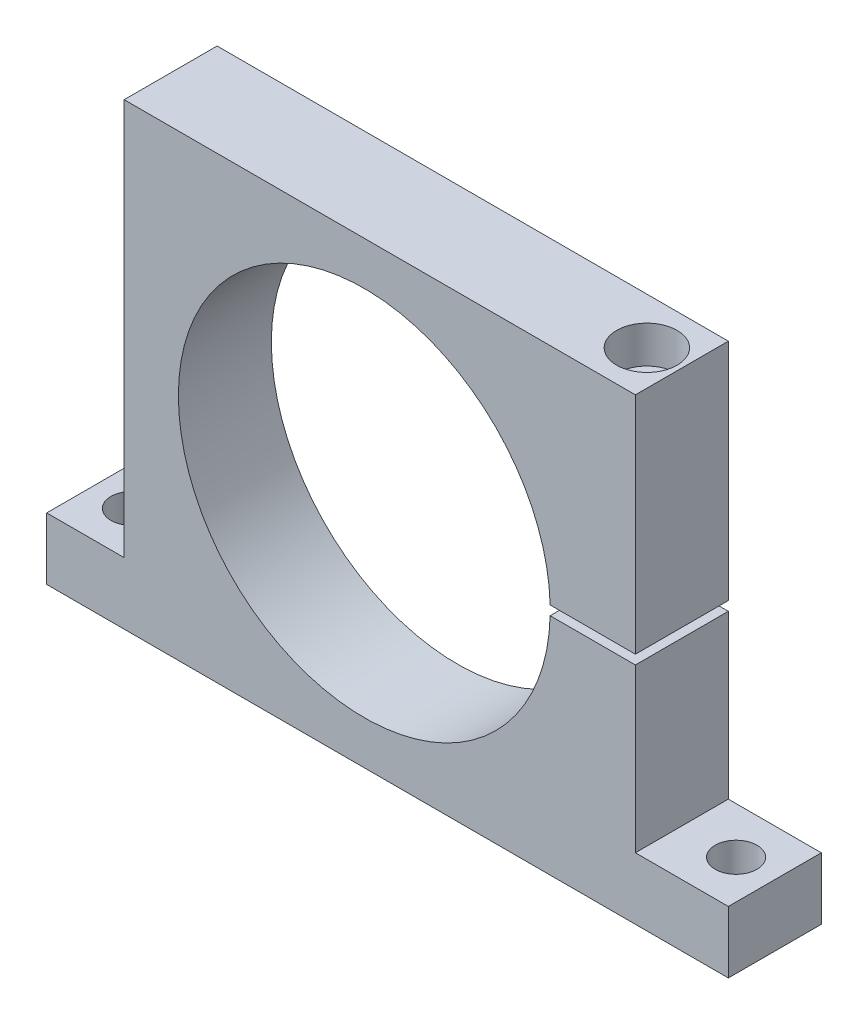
ISO-10303-21;
HEADER;
FILE_DESCRIPTION(('STEP AP214'),'2;1');
FILE_NAME('part.step','',(''),(''),'','','');
FILE_SCHEMA(('AUTOMOTIVE_DESIGN { 1 0 10303 214 1 1 1 1 }'));
ENDSEC;
DATA;
#1=APPLICATION_CONTEXT('core data for automotive mechanical design processes');
#2=APPLICATION_PROTOCOL_DEFINITION('international standard','automotive_design',2000,#1);
#3=PRODUCT_CONTEXT('',#1,'mechanical');
#4=PRODUCT('Part','Part','',(#3));
#5=PRODUCT_RELATED_PRODUCT_CATEGORY('part','',(#4));
#6=PRODUCT_DEFINITION_FORMATION('','',#4);
#7=PRODUCT_DEFINITION_CONTEXT('part definition',#1,'design');
#8=PRODUCT_DEFINITION('design','',#6,#7);
#9=PRODUCT_DEFINITION_SHAPE('','',#8);
#10=(LENGTH_UNIT() NAMED_UNIT(*) SI_UNIT(.MILLI.,.METRE.));
#11=(NAMED_UNIT(*) PLANE_ANGLE_UNIT() SI_UNIT($,.RADIAN.));
#12=(NAMED_UNIT(*) SI_UNIT($,.STERADIAN.) SOLID_ANGLE_UNIT());
#13=UNCERTAINTY_MEASURE_WITH_UNIT(LENGTH_MEASURE(1.E-05),#10,'distance_accuracy_value','');
#14=(GEOMETRIC_REPRESENTATION_CONTEXT(3) GLOBAL_UNCERTAINTY_ASSIGNED_CONTEXT((#13)) GLOBAL_UNIT_ASSIGNED_CONTEXT((#10,
#11,#12)) REPRESENTATION_CONTEXT('',''));
#15=CARTESIAN_POINT('',(0.,0.,0.));
#16=DIRECTION('',(0.,0.,1.));
#17=DIRECTION('',(1.,0.,0.));
#18=AXIS2_PLACEMENT_3D('',#15,#16,#17);
#19=CARTESIAN_POINT('',(87.5,1.49999999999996,15.));
#20=DIRECTION('',(0.,1.,0.));
#21=DIRECTION('',(0.,0.,1.));
#22=AXIS2_PLACEMENT_3D('',#19,#20,#21);
#23=PLANE('',#22);
#24=DIRECTION('',(1.,0.,0.));
#25=VECTOR('',#24,1.);
#26=CARTESIAN_POINT('',(87.5,1.49999999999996,-15.));
#27=LINE('',#26,#25);
#28=CARTESIAN_POINT('',(59.9812470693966,1.49999999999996,-15.));
#29=VERTEX_POINT('',#28);
#30=CARTESIAN_POINT('',(87.5,1.49999999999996,-15.));
#31=VERTEX_POINT('',#30);
#32=EDGE_CURVE('E164',#29,#31,#27,.T.);
#33=ORIENTED_EDGE('',*,*,#32,.T.);
#34=DIRECTION('',(0.,0.,-1.));
#35=VECTOR('',#34,1.);
#36=CARTESIAN_POINT('',(87.5,1.49999999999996,15.));
#37=LINE('',#36,#35);
#38=CARTESIAN_POINT('',(87.5,1.49999999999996,15.));
#39=VERTEX_POINT('',#38);
#40=EDGE_CURVE('E47',#39,#31,#37,.T.);
#41=ORIENTED_EDGE('',*,*,#40,.F.);
#42=DIRECTION('',(1.,0.,0.));
#43=VECTOR('',#42,1.);
#44=CARTESIAN_POINT('',(87.5,1.49999999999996,15.));
#45=LINE('',#44,#43);
#46=CARTESIAN_POINT('',(59.9812470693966,1.49999999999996,15.));
#47=VERTEX_POINT('',#46);
#48=EDGE_CURVE('E111',#47,#39,#45,.T.);
#49=ORIENTED_EDGE('',*,*,#48,.F.);
#50=DIRECTION('',(0.,0.,-1.));
#51=VECTOR('',#50,1.);
#52=CARTESIAN_POINT('',(59.9812470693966,1.49999999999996,15.));
#53=LINE('',#52,#51);
#54=EDGE_CURVE('E11',#47,#29,#53,.T.);
#55=ORIENTED_EDGE('',*,*,#54,.T.);
#56=EDGE_LOOP('',(#33,#41,#49,#55));
#57=FACE_BOUND('',#56,.T.);
#58=CARTESIAN_POINT('',(76.2,1.49999999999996,0.));
#59=DIRECTION('',(0.,1.,0.));
#60=DIRECTION('',(0.,0.,1.));
#61=AXIS2_PLACEMENT_3D('',#58,#59,#60);
#62=CIRCLE('',#61,6.00000000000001);
#63=CARTESIAN_POINT('',(76.2,1.49999999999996,6.00000000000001));
#64=VERTEX_POINT('',#63);
#65=EDGE_CURVE('E260',#64,#64,#62,.F.);
#66=ORIENTED_EDGE('',*,*,#65,.F.);
#67=EDGE_LOOP('',(#66));
#68=FACE_BOUND('',#67,.T.);
#69=ADVANCED_FACE('F37',(#57,#68),#23,.F.);
#70=CARTESIAN_POINT('',(-77.5,74.,15.));
#71=DIRECTION('',(0.,-1.,0.));
#72=DIRECTION('',(0.,0.,-1.));
#73=AXIS2_PLACEMENT_3D('',#70,#71,#72);
#74=PLANE('',#73);
#75=DIRECTION('',(-1.,0.,0.));
#76=VECTOR('',#75,1.);
#77=CARTESIAN_POINT('',(-77.5,74.,-15.));
#78=LINE('',#77,#76);
#79=CARTESIAN_POINT('',(87.5,74.,-15.));
#80=VERTEX_POINT('',#79);
#81=CARTESIAN_POINT('',(-77.5,74.,-15.));
#82=VERTEX_POINT('',#81);
#83=EDGE_CURVE('E169',#80,#82,#78,.T.);
#84=ORIENTED_EDGE('',*,*,#83,.T.);
#85=DIRECTION('',(0.,0.,-1.));
#86=VECTOR('',#85,1.);
#87=CARTESIAN_POINT('',(-77.5,74.,15.));
#88=LINE('',#87,#86);
#89=CARTESIAN_POINT('',(-77.5,74.,15.));
#90=VERTEX_POINT('',#89);
#91=EDGE_CURVE('E200',#90,#82,#88,.T.);
#92=ORIENTED_EDGE('',*,*,#91,.F.);
#93=DIRECTION('',(-1.,0.,0.));
#94=VECTOR('',#93,1.);
#95=CARTESIAN_POINT('',(-77.5,74.,15.));
#96=LINE('',#95,#94);
#97=CARTESIAN_POINT('',(87.5,74.,15.));
#98=VERTEX_POINT('',#97);
#99=EDGE_CURVE('E231',#98,#90,#96,.T.);
#100=ORIENTED_EDGE('',*,*,#99,.F.);
#101=DIRECTION('',(0.,0.,-1.));
#102=VECTOR('',#101,1.);
#103=CARTESIAN_POINT('',(87.5,74.,15.));
#104=LINE('',#103,#102);
#105=EDGE_CURVE('E203',#98,#80,#104,.T.);
#106=ORIENTED_EDGE('',*,*,#105,.T.);
#107=EDGE_LOOP('',(#84,#92,#100,#106));
#108=FACE_BOUND('',#107,.T.);
#109=CARTESIAN_POINT('',(76.2,74.,0.));
#110=DIRECTION('',(0.,1.,0.));
#111=DIRECTION('',(-1.,0.,0.));
#112=AXIS2_PLACEMENT_3D('',#109,#110,#111);
#113=CIRCLE('',#112,9.74999999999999);
#114=CARTESIAN_POINT('',(66.45,74.,0.));
#115=VERTEX_POINT('',#114);
#116=EDGE_CURVE('E261',#115,#115,#113,.T.);
#117=ORIENTED_EDGE('',*,*,#116,.F.);
#118=EDGE_LOOP('',(#117));
#119=FACE_BOUND('',#118,.T.);
#120=ADVANCED_FACE('F221',(#108,#119),#74,.F.);
#121=CARTESIAN_POINT('',(87.5,-1.50000000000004,15.));
#122=DIRECTION('',(0.,-1.,0.));
#123=DIRECTION('',(0.,0.,-1.));
#124=AXIS2_PLACEMENT_3D('',#121,#122,#123);
#125=PLANE('',#124);
#126=DIRECTION('',(-1.,0.,0.));
#127=VECTOR('',#126,1.);
#128=CARTESIAN_POINT('',(87.5,-1.50000000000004,-15.));
#129=LINE('',#128,#127);
#130=CARTESIAN_POINT('',(87.5,-1.50000000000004,-15.));
#131=VERTEX_POINT('',#130);
#132=CARTESIAN_POINT('',(59.9812470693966,-1.50000000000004,-15.));
#133=VERTEX_POINT('',#132);
#134=EDGE_CURVE('E103',#131,#133,#129,.T.);
#135=ORIENTED_EDGE('',*,*,#134,.T.);
#136=DIRECTION('',(0.,0.,-1.));
#137=VECTOR('',#136,1.);
#138=CARTESIAN_POINT('',(59.9812470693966,-1.50000000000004,15.));
#139=LINE('',#138,#137);
#140=CARTESIAN_POINT('',(59.9812470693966,-1.50000000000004,15.));
#141=VERTEX_POINT('',#140);
#142=EDGE_CURVE('E157',#141,#133,#139,.T.);
#143=ORIENTED_EDGE('',*,*,#142,.F.);
#144=DIRECTION('',(-1.,0.,0.));
#145=VECTOR('',#144,1.);
#146=CARTESIAN_POINT('',(87.5,-1.50000000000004,15.));
#147=LINE('',#146,#145);
#148=CARTESIAN_POINT('',(87.5,-1.50000000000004,15.));
#149=VERTEX_POINT('',#148);
#150=EDGE_CURVE('E55',#149,#141,#147,.T.);
#151=ORIENTED_EDGE('',*,*,#150,.F.);
#152=DIRECTION('',(0.,0.,-1.));
#153=VECTOR('',#152,1.);
#154=CARTESIAN_POINT('',(87.5,-1.50000000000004,15.));
#155=LINE('',#154,#153);
#156=EDGE_CURVE('E153',#149,#131,#155,.T.);
#157=ORIENTED_EDGE('',*,*,#156,.T.);
#158=EDGE_LOOP('',(#135,#143,#151,#157));
#159=FACE_BOUND('',#158,.T.);
#160=CARTESIAN_POINT('',(76.2,-1.50000000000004,0.));
#161=DIRECTION('',(0.,-1.,0.));
#162=DIRECTION('',(0.,0.,-1.));
#163=AXIS2_PLACEMENT_3D('',#160,#161,#162);
#164=CIRCLE('',#163,6.00000000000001);
#165=CARTESIAN_POINT('',(76.2,-1.50000000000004,-6.00000000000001));
#166=VERTEX_POINT('',#165);
#167=EDGE_CURVE('E41',#166,#166,#164,.F.);
#168=ORIENTED_EDGE('',*,*,#167,.F.);
#169=EDGE_LOOP('',(#168));
#170=FACE_BOUND('',#169,.T.);
#171=ADVANCED_FACE('F253',(#159,#170),#125,.F.);
#172=CARTESIAN_POINT('',(0.,0.,15.));
#173=DIRECTION('',(0.,0.,-1.));
#174=DIRECTION('',(-1.,0.,0.));
#175=AXIS2_PLACEMENT_3D('',#172,#173,#174);
#176=CYLINDRICAL_SURFACE('',#175,60.);
#177=CARTESIAN_POINT('',(0.,0.,-15.));
#178=DIRECTION('',(0.,0.,-1.));
#179=DIRECTION('',(1.,0.,0.));
#180=AXIS2_PLACEMENT_3D('',#177,#178,#179);
#181=CIRCLE('',#180,60.);
#182=EDGE_CURVE('E161',#133,#29,#181,.T.);
#183=ORIENTED_EDGE('',*,*,#182,.T.);
#184=ORIENTED_EDGE('',*,*,#54,.F.);
#185=CARTESIAN_POINT('',(0.,0.,15.));
#186=DIRECTION('',(0.,0.,-1.));
#187=DIRECTION('',(1.,0.,0.));
#188=AXIS2_PLACEMENT_3D('',#185,#186,#187);
#189=CIRCLE('',#188,60.);
#190=EDGE_CURVE('E184',#141,#47,#189,.T.);
#191=ORIENTED_EDGE('',*,*,#190,.F.);
#192=ORIENTED_EDGE('',*,*,#142,.T.);
#193=EDGE_LOOP('',(#183,#184,#191,#192));
#194=FACE_BOUND('',#193,.T.);
#195=ADVANCED_FACE('F39',(#194),#176,.F.);
#196=CARTESIAN_POINT('',(87.5,74.,15.));
#197=DIRECTION('',(-1.,0.,0.));
#198=DIRECTION('',(0.,0.,1.));
#199=AXIS2_PLACEMENT_3D('',#196,#197,#198);
#200=PLANE('',#199);
#201=DIRECTION('',(0.,1.,0.));
#202=VECTOR('',#201,1.);
#203=CARTESIAN_POINT('',(87.5,74.,-15.));
#204=LINE('',#203,#202);
#205=EDGE_CURVE('E167',#31,#80,#204,.T.);
#206=ORIENTED_EDGE('',*,*,#205,.T.);
#207=ORIENTED_EDGE('',*,*,#105,.F.);
#208=DIRECTION('',(0.,1.,0.));
#209=VECTOR('',#208,1.);
#210=CARTESIAN_POINT('',(87.5,74.,15.));
#211=LINE('',#210,#209);
#212=EDGE_CURVE('E212',#39,#98,#211,.T.);
#213=ORIENTED_EDGE('',*,*,#212,.F.);
#214=ORIENTED_EDGE('',*,*,#40,.T.);
#215=EDGE_LOOP('',(#206,#207,#213,#214));
#216=FACE_BOUND('',#215,.T.);
#217=ADVANCED_FACE('F210',(#216),#200,.F.);
#218=CARTESIAN_POINT('',(-77.5,-54.,15.));
#219=DIRECTION('',(1.,0.,0.));
#220=DIRECTION('',(0.,0.,-1.));
#221=AXIS2_PLACEMENT_3D('',#218,#219,#220);
#222=PLANE('',#221);
#223=DIRECTION('',(0.,-1.,0.));
#224=VECTOR('',#223,1.);
#225=CARTESIAN_POINT('',(-77.5,-54.,-15.));
#226=LINE('',#225,#224);
#227=CARTESIAN_POINT('',(-77.5,-54.,-15.));
#228=VERTEX_POINT('',#227);
#229=EDGE_CURVE('E171',#82,#228,#226,.T.);
#230=ORIENTED_EDGE('',*,*,#229,.T.);
#231=DIRECTION('',(0.,0.,-1.));
#232=VECTOR('',#231,1.);
#233=CARTESIAN_POINT('',(-77.5,-54.,15.));
#234=LINE('',#233,#232);
#235=CARTESIAN_POINT('',(-77.5,-54.,15.));
#236=VERTEX_POINT('',#235);
#237=EDGE_CURVE('E197',#236,#228,#234,.T.);
#238=ORIENTED_EDGE('',*,*,#237,.F.);
#239=DIRECTION('',(0.,-1.,0.));
#240=VECTOR('',#239,1.);
#241=CARTESIAN_POINT('',(-77.5,-54.,15.));
#242=LINE('',#241,#240);
#243=EDGE_CURVE('E228',#90,#236,#242,.T.);
#244=ORIENTED_EDGE('',*,*,#243,.F.);
#245=ORIENTED_EDGE('',*,*,#91,.T.);
#246=EDGE_LOOP('',(#230,#238,#244,#245));
#247=FACE_BOUND('',#246,.T.);
#248=ADVANCED_FACE('F226',(#247),#222,.F.);
#249=CARTESIAN_POINT('',(-102.5,-54.,15.));
#250=DIRECTION('',(0.,-1.,0.));
#251=DIRECTION('',(0.,0.,-1.));
#252=AXIS2_PLACEMENT_3D('',#249,#250,#251);
#253=PLANE('',#252);
#254=CARTESIAN_POINT('',(-90.,-54.,0.));
#255=DIRECTION('',(0.,-1.,0.));
#256=DIRECTION('',(1.,0.,0.));
#257=AXIS2_PLACEMENT_3D('',#254,#255,#256);
#258=CIRCLE('',#257,6.75);
#259=CARTESIAN_POINT('',(-83.25,-54.,0.));
#260=VERTEX_POINT('',#259);
#261=EDGE_CURVE('E165',#260,#260,#258,.T.);
#262=ORIENTED_EDGE('',*,*,#261,.T.);
#263=EDGE_LOOP('',(#262));
#264=FACE_BOUND('',#263,.T.);
#265=DIRECTION('',(-1.,0.,0.));
#266=VECTOR('',#265,1.);
#267=CARTESIAN_POINT('',(-102.5,-54.,-15.));
#268=LINE('',#267,#266);
#269=CARTESIAN_POINT('',(-102.5,-54.,-15.));
#270=VERTEX_POINT('',#269);
#271=EDGE_CURVE('E173',#228,#270,#268,.T.);
#272=ORIENTED_EDGE('',*,*,#271,.T.);
#273=DIRECTION('',(0.,0.,-1.));
#274=VECTOR('',#273,1.);
#275=CARTESIAN_POINT('',(-102.5,-54.,15.));
#276=LINE('',#275,#274);
#277=CARTESIAN_POINT('',(-102.5,-54.,15.));
#278=VERTEX_POINT('',#277);
#279=EDGE_CURVE('E194',#278,#270,#276,.T.);
#280=ORIENTED_EDGE('',*,*,#279,.F.);
#281=DIRECTION('',(-1.,0.,0.));
#282=VECTOR('',#281,1.);
#283=CARTESIAN_POINT('',(-102.5,-54.,15.));
#284=LINE('',#283,#282);
#285=EDGE_CURVE('E230',#236,#278,#284,.T.);
#286=ORIENTED_EDGE('',*,*,#285,.F.);
#287=ORIENTED_EDGE('',*,*,#237,.T.);
#288=EDGE_LOOP('',(#272,#280,#286,#287));
#289=FACE_BOUND('',#288,.T.);
#290=ADVANCED_FACE('F299',(#264,#289),#253,.F.);
#291=CARTESIAN_POINT('',(-102.5,-74.,15.));
#292=DIRECTION('',(1.,0.,0.));
#293=DIRECTION('',(0.,0.,-1.));
#294=AXIS2_PLACEMENT_3D('',#291,#292,#293);
#295=PLANE('',#294);
#296=DIRECTION('',(0.,-1.,0.));
#297=VECTOR('',#296,1.);
#298=CARTESIAN_POINT('',(-102.5,-74.,-15.));
#299=LINE('',#298,#297);
#300=CARTESIAN_POINT('',(-102.5,-74.,-15.));
#301=VERTEX_POINT('',#300);
#302=EDGE_CURVE('E175',#270,#301,#299,.T.);
#303=ORIENTED_EDGE('',*,*,#302,.T.);
#304=DIRECTION('',(0.,0.,-1.));
#305=VECTOR('',#304,1.);
#306=CARTESIAN_POINT('',(-102.5,-74.,15.));
#307=LINE('',#306,#305);
#308=CARTESIAN_POINT('',(-102.5,-74.,15.));
#309=VERTEX_POINT('',#308);
#310=EDGE_CURVE('E191',#309,#301,#307,.T.);
#311=ORIENTED_EDGE('',*,*,#310,.F.);
#312=DIRECTION('',(0.,-1.,0.));
#313=VECTOR('',#312,1.);
#314=CARTESIAN_POINT('',(-102.5,-74.,15.));
#315=LINE('',#314,#313);
#316=EDGE_CURVE('E233',#278,#309,#315,.T.);
#317=ORIENTED_EDGE('',*,*,#316,.F.);
#318=ORIENTED_EDGE('',*,*,#279,.T.);
#319=EDGE_LOOP('',(#303,#311,#317,#318));
#320=FACE_BOUND('',#319,.T.);
#321=ADVANCED_FACE('F291',(#320),#295,.F.);
#322=CARTESIAN_POINT('',(117.5,-74.,15.));
#323=DIRECTION('',(0.,1.,0.));
#324=DIRECTION('',(0.,0.,1.));
#325=AXIS2_PLACEMENT_3D('',#322,#323,#324);
#326=PLANE('',#325);
#327=CARTESIAN_POINT('',(105.,-74.,0.));
#328=DIRECTION('',(0.,-1.,0.));
#329=DIRECTION('',(1.,0.,0.));
#330=AXIS2_PLACEMENT_3D('',#327,#328,#329);
#331=CIRCLE('',#330,6.75);
#332=CARTESIAN_POINT('',(111.75,-74.,0.));
#333=VERTEX_POINT('',#332);
#334=EDGE_CURVE('E263',#333,#333,#331,.T.);
#335=ORIENTED_EDGE('',*,*,#334,.F.);
#336=EDGE_LOOP('',(#335));
#337=FACE_BOUND('',#336,.T.);
#338=CARTESIAN_POINT('',(-90.,-74.,0.));
#339=DIRECTION('',(0.,-1.,0.));
#340=DIRECTION('',(1.,0.,0.));
#341=AXIS2_PLACEMENT_3D('',#338,#339,#340);
#342=CIRCLE('',#341,6.75);
#343=CARTESIAN_POINT('',(-83.25,-74.,0.));
#344=VERTEX_POINT('',#343);
#345=EDGE_CURVE('E278',#344,#344,#342,.T.);
#346=ORIENTED_EDGE('',*,*,#345,.F.);
#347=EDGE_LOOP('',(#346));
#348=FACE_BOUND('',#347,.T.);
#349=DIRECTION('',(1.,0.,0.));
#350=VECTOR('',#349,1.);
#351=CARTESIAN_POINT('',(117.5,-74.,-15.));
#352=LINE('',#351,#350);
#353=CARTESIAN_POINT('',(117.5,-74.,-15.));
#354=VERTEX_POINT('',#353);
#355=EDGE_CURVE('E177',#301,#354,#352,.T.);
#356=ORIENTED_EDGE('',*,*,#355,.T.);
#357=DIRECTION('',(0.,0.,-1.));
#358=VECTOR('',#357,1.);
#359=CARTESIAN_POINT('',(117.5,-74.,15.));
#360=LINE('',#359,#358);
#361=CARTESIAN_POINT('',(117.5,-74.,15.));
#362=VERTEX_POINT('',#361);
#363=EDGE_CURVE('E188',#362,#354,#360,.T.);
#364=ORIENTED_EDGE('',*,*,#363,.F.);
#365=DIRECTION('',(1.,0.,0.));
#366=VECTOR('',#365,1.);
#367=CARTESIAN_POINT('',(117.5,-74.,15.));
#368=LINE('',#367,#366);
#369=EDGE_CURVE('E239',#309,#362,#368,.T.);
#370=ORIENTED_EDGE('',*,*,#369,.F.);
#371=ORIENTED_EDGE('',*,*,#310,.T.);
#372=EDGE_LOOP('',(#356,#364,#370,#371));
#373=FACE_BOUND('',#372,.T.);
#374=ADVANCED_FACE('F245',(#337,#348,#373),#326,.F.);
#375=CARTESIAN_POINT('',(117.5,-54.,15.));
#376=DIRECTION('',(-1.,0.,0.));
#377=DIRECTION('',(0.,0.,1.));
#378=AXIS2_PLACEMENT_3D('',#375,#376,#377);
#379=PLANE('',#378);
#380=DIRECTION('',(0.,1.,0.));
#381=VECTOR('',#380,1.);
#382=CARTESIAN_POINT('',(117.5,-54.,-15.));
#383=LINE('',#382,#381);
#384=CARTESIAN_POINT('',(117.5,-54.,-15.));
#385=VERTEX_POINT('',#384);
#386=EDGE_CURVE('E179',#354,#385,#383,.T.);
#387=ORIENTED_EDGE('',*,*,#386,.T.);
#388=DIRECTION('',(0.,0.,-1.));
#389=VECTOR('',#388,1.);
#390=CARTESIAN_POINT('',(117.5,-54.,15.));
#391=LINE('',#390,#389);
#392=CARTESIAN_POINT('',(117.5,-54.,15.));
#393=VERTEX_POINT('',#392);
#394=EDGE_CURVE('E152',#393,#385,#391,.T.);
#395=ORIENTED_EDGE('',*,*,#394,.F.);
#396=DIRECTION('',(0.,1.,0.));
#397=VECTOR('',#396,1.);
#398=CARTESIAN_POINT('',(117.5,-54.,15.));
#399=LINE('',#398,#397);
#400=EDGE_CURVE('E143',#362,#393,#399,.T.);
#401=ORIENTED_EDGE('',*,*,#400,.F.);
#402=ORIENTED_EDGE('',*,*,#363,.T.);
#403=EDGE_LOOP('',(#387,#395,#401,#402));
#404=FACE_BOUND('',#403,.T.);
#405=ADVANCED_FACE('F249',(#404),#379,.F.);
#406=CARTESIAN_POINT('',(87.5,-54.,15.));
#407=DIRECTION('',(0.,-1.,0.));
#408=DIRECTION('',(0.,0.,-1.));
#409=AXIS2_PLACEMENT_3D('',#406,#407,#408);
#410=PLANE('',#409);
#411=CARTESIAN_POINT('',(105.,-54.,0.));
#412=DIRECTION('',(0.,-1.,0.));
#413=DIRECTION('',(1.,0.,0.));
#414=AXIS2_PLACEMENT_3D('',#411,#412,#413);
#415=CIRCLE('',#414,6.75);
#416=CARTESIAN_POINT('',(111.75,-54.,0.));
#417=VERTEX_POINT('',#416);
#418=EDGE_CURVE('E275',#417,#417,#415,.T.);
#419=ORIENTED_EDGE('',*,*,#418,.T.);
#420=EDGE_LOOP('',(#419));
#421=FACE_BOUND('',#420,.T.);
#422=DIRECTION('',(-1.,0.,0.));
#423=VECTOR('',#422,1.);
#424=CARTESIAN_POINT('',(87.5,-54.,-15.));
#425=LINE('',#424,#423);
#426=CARTESIAN_POINT('',(87.5,-54.,-15.));
#427=VERTEX_POINT('',#426);
#428=EDGE_CURVE('E151',#385,#427,#425,.T.);
#429=ORIENTED_EDGE('',*,*,#428,.T.);
#430=DIRECTION('',(0.,0.,-1.));
#431=VECTOR('',#430,1.);
#432=CARTESIAN_POINT('',(87.5,-54.,15.));
#433=LINE('',#432,#431);
#434=CARTESIAN_POINT('',(87.5,-54.,15.));
#435=VERTEX_POINT('',#434);
#436=EDGE_CURVE('E148',#435,#427,#433,.T.);
#437=ORIENTED_EDGE('',*,*,#436,.F.);
#438=DIRECTION('',(-1.,0.,0.));
#439=VECTOR('',#438,1.);
#440=CARTESIAN_POINT('',(87.5,-54.,15.));
#441=LINE('',#440,#439);
#442=EDGE_CURVE('E137',#393,#435,#441,.T.);
#443=ORIENTED_EDGE('',*,*,#442,.F.);
#444=ORIENTED_EDGE('',*,*,#394,.T.);
#445=EDGE_LOOP('',(#429,#437,#443,#444));
#446=FACE_BOUND('',#445,.T.);
#447=ADVANCED_FACE('F149',(#421,#446),#410,.F.);
#448=CARTESIAN_POINT('',(87.5,-1.50000000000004,15.));
#449=DIRECTION('',(-1.,0.,0.));
#450=DIRECTION('',(0.,0.,1.));
#451=AXIS2_PLACEMENT_3D('',#448,#449,#450);
#452=PLANE('',#451);
#453=DIRECTION('',(0.,1.,0.));
#454=VECTOR('',#453,1.);
#455=CARTESIAN_POINT('',(87.5,-1.50000000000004,-15.));
#456=LINE('',#455,#454);
#457=EDGE_CURVE('E97',#427,#131,#456,.T.);
#458=ORIENTED_EDGE('',*,*,#457,.T.);
#459=ORIENTED_EDGE('',*,*,#156,.F.);
#460=DIRECTION('',(0.,1.,0.));
#461=VECTOR('',#460,1.);
#462=CARTESIAN_POINT('',(87.5,-1.50000000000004,15.));
#463=LINE('',#462,#461);
#464=EDGE_CURVE('E141',#435,#149,#463,.T.);
#465=ORIENTED_EDGE('',*,*,#464,.F.);
#466=ORIENTED_EDGE('',*,*,#436,.T.);
#467=EDGE_LOOP('',(#458,#459,#465,#466));
#468=FACE_BOUND('',#467,.T.);
#469=ADVANCED_FACE('F155',(#468),#452,.F.);
#470=CARTESIAN_POINT('',(0.,0.,15.));
#471=DIRECTION('',(0.,0.,1.));
#472=DIRECTION('',(1.,0.,0.));
#473=AXIS2_PLACEMENT_3D('',#470,#471,#472);
#474=PLANE('',#473);
#475=ORIENTED_EDGE('',*,*,#190,.T.);
#476=ORIENTED_EDGE('',*,*,#48,.T.);
#477=ORIENTED_EDGE('',*,*,#212,.T.);
#478=ORIENTED_EDGE('',*,*,#99,.T.);
#479=ORIENTED_EDGE('',*,*,#243,.T.);
#480=ORIENTED_EDGE('',*,*,#285,.T.);
#481=ORIENTED_EDGE('',*,*,#316,.T.);
#482=ORIENTED_EDGE('',*,*,#369,.T.);
#483=ORIENTED_EDGE('',*,*,#400,.T.);
#484=ORIENTED_EDGE('',*,*,#442,.T.);
#485=ORIENTED_EDGE('',*,*,#464,.T.);
#486=ORIENTED_EDGE('',*,*,#150,.T.);
#487=EDGE_LOOP('',(#475,#476,#477,#478,#479,#480,#481,#482,#483,#484,#485,#486));
#488=FACE_BOUND('',#487,.T.);
#489=ADVANCED_FACE('F139',(#488),#474,.T.);
#490=CARTESIAN_POINT('',(0.,0.,-15.));
#491=DIRECTION('',(0.,0.,1.));
#492=DIRECTION('',(1.,0.,0.));
#493=AXIS2_PLACEMENT_3D('',#490,#491,#492);
#494=PLANE('',#493);
#495=ORIENTED_EDGE('',*,*,#182,.F.);
#496=ORIENTED_EDGE('',*,*,#134,.F.);
#497=ORIENTED_EDGE('',*,*,#457,.F.);
#498=ORIENTED_EDGE('',*,*,#428,.F.);
#499=ORIENTED_EDGE('',*,*,#386,.F.);
#500=ORIENTED_EDGE('',*,*,#355,.F.);
#501=ORIENTED_EDGE('',*,*,#302,.F.);
#502=ORIENTED_EDGE('',*,*,#271,.F.);
#503=ORIENTED_EDGE('',*,*,#229,.F.);
#504=ORIENTED_EDGE('',*,*,#83,.F.);
#505=ORIENTED_EDGE('',*,*,#205,.F.);
#506=ORIENTED_EDGE('',*,*,#32,.F.);
#507=EDGE_LOOP('',(#495,#496,#497,#498,#499,#500,#501,#502,#503,#504,#505,#506));
#508=FACE_BOUND('',#507,.T.);
#509=ADVANCED_FACE('F216',(#508),#494,.F.);
#510=CARTESIAN_POINT('',(-90.,-54.,0.));
#511=DIRECTION('',(0.,-1.,0.));
#512=DIRECTION('',(1.,0.,0.));
#513=AXIS2_PLACEMENT_3D('',#510,#511,#512);
#514=CYLINDRICAL_SURFACE('',#513,6.75);
#515=ORIENTED_EDGE('',*,*,#261,.F.);
#516=EDGE_LOOP('',(#515));
#517=FACE_BOUND('',#516,.T.);
#518=ORIENTED_EDGE('',*,*,#345,.T.);
#519=EDGE_LOOP('',(#518));
#520=FACE_BOUND('',#519,.T.);
#521=ADVANCED_FACE('F288',(#517,#520),#514,.F.);
#522=CARTESIAN_POINT('',(105.,-54.,0.));
#523=DIRECTION('',(0.,-1.,0.));
#524=DIRECTION('',(1.,0.,0.));
#525=AXIS2_PLACEMENT_3D('',#522,#523,#524);
#526=CYLINDRICAL_SURFACE('',#525,6.75);
#527=ORIENTED_EDGE('',*,*,#418,.F.);
#528=EDGE_LOOP('',(#527));
#529=FACE_BOUND('',#528,.T.);
#530=ORIENTED_EDGE('',*,*,#334,.T.);
#531=EDGE_LOOP('',(#530));
#532=FACE_BOUND('',#531,.T.);
#533=ADVANCED_FACE('F324',(#529,#532),#526,.F.);
#534=CARTESIAN_POINT('',(76.2,-49.6051637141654,0.));
#535=DIRECTION('',(0.,1.,0.));
#536=DIRECTION('',(-1.,0.,0.));
#537=AXIS2_PLACEMENT_3D('',#534,#535,#536);
#538=CONICAL_SURFACE('',#537,0.,1.02974425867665);
#539=CARTESIAN_POINT('',(76.2,-46.,0.));
#540=DIRECTION('',(0.,1.,0.));
#541=DIRECTION('',(-1.,0.,0.));
#542=AXIS2_PLACEMENT_3D('',#539,#540,#541);
#543=CIRCLE('',#542,6.00000000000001);
#544=CARTESIAN_POINT('',(70.2,-46.,0.));
#545=VERTEX_POINT('',#544);
#546=EDGE_CURVE('E481',#545,#545,#543,.T.);
#547=ORIENTED_EDGE('',*,*,#546,.T.);
#548=EDGE_LOOP('',(#547));
#549=FACE_BOUND('',#548,.T.);
#550=CARTESIAN_POINT('',(76.2,-49.6051637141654,0.));
#551=VERTEX_POINT('',#550);
#552=VERTEX_LOOP('',#551);
#553=FACE_BOUND('',#552,.T.);
#554=ADVANCED_FACE('F330',(#549,#553),#538,.F.);
#555=CARTESIAN_POINT('',(76.2,74.,0.));
#556=DIRECTION('',(0.,1.,0.));
#557=DIRECTION('',(-1.,0.,0.));
#558=AXIS2_PLACEMENT_3D('',#555,#556,#557);
#559=CYLINDRICAL_SURFACE('',#558,6.00000000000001);
#560=ORIENTED_EDGE('',*,*,#546,.F.);
#561=EDGE_LOOP('',(#560));
#562=FACE_BOUND('',#561,.T.);
#563=ORIENTED_EDGE('',*,*,#167,.T.);
#564=EDGE_LOOP('',(#563));
#565=FACE_BOUND('',#564,.T.);
#566=ADVANCED_FACE('F436',(#562,#565),#559,.F.);
#567=CARTESIAN_POINT('',(76.2,62.,0.));
#568=DIRECTION('',(0.,1.,0.));
#569=DIRECTION('',(-1.,0.,0.));
#570=AXIS2_PLACEMENT_3D('',#567,#568,#569);
#571=CIRCLE('',#570,6.);
#572=CARTESIAN_POINT('',(70.2,62.,0.));
#573=VERTEX_POINT('',#572);
#574=EDGE_CURVE('E271',#573,#573,#571,.T.);
#575=ORIENTED_EDGE('',*,*,#574,.T.);
#576=EDGE_LOOP('',(#575));
#577=FACE_BOUND('',#576,.T.);
#578=ORIENTED_EDGE('',*,*,#65,.T.);
#579=EDGE_LOOP('',(#578));
#580=FACE_BOUND('',#579,.T.);
#581=ADVANCED_FACE('F443',(#577,#580),#559,.F.);
#582=CARTESIAN_POINT('',(76.2,74.,0.));
#583=DIRECTION('',(0.,1.,0.));
#584=DIRECTION('',(-1.,0.,0.));
#585=AXIS2_PLACEMENT_3D('',#582,#583,#584);
#586=CYLINDRICAL_SURFACE('',#585,9.74999999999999);
#587=ORIENTED_EDGE('',*,*,#116,.T.);
#588=EDGE_LOOP('',(#587));
#589=FACE_BOUND('',#588,.T.);
#590=CARTESIAN_POINT('',(76.2,62.,0.));
#591=DIRECTION('',(0.,1.,0.));
#592=DIRECTION('',(-1.,0.,0.));
#593=AXIS2_PLACEMENT_3D('',#590,#591,#592);
#594=CIRCLE('',#593,9.74999999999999);
#595=CARTESIAN_POINT('',(66.45,62.,0.));
#596=VERTEX_POINT('',#595);
#597=EDGE_CURVE('E266',#596,#596,#594,.T.);
#598=ORIENTED_EDGE('',*,*,#597,.F.);
#599=EDGE_LOOP('',(#598));
#600=FACE_BOUND('',#599,.T.);
#601=ADVANCED_FACE('F451',(#589,#600),#586,.F.);
#602=CARTESIAN_POINT('',(85.95,62.,0.));
#603=DIRECTION('',(0.,1.,0.));
#604=DIRECTION('',(-1.,0.,0.));
#605=AXIS2_PLACEMENT_3D('',#602,#603,#604);
#606=PLANE('',#605);
#607=ORIENTED_EDGE('',*,*,#597,.T.);
#608=EDGE_LOOP('',(#607));
#609=FACE_BOUND('',#608,.T.);
#610=ORIENTED_EDGE('',*,*,#574,.F.);
#611=EDGE_LOOP('',(#610));
#612=FACE_BOUND('',#611,.T.);
#613=ADVANCED_FACE('F458',(#609,#612),#606,.T.);
#614=CLOSED_SHELL('',(#69,#120,#171,#195,#217,#248,#290,#321,#374,#405,#447,#469,#489,#509,#521,
#533,#554,#566,#581,#601,#613));
#615=MANIFOLD_SOLID_BREP('B2',#614);
#616=ADVANCED_BREP_SHAPE_REPRESENTATION('',(#18,#615),#14);
#617=SHAPE_DEFINITION_REPRESENTATION(#9,#616);
ENDSEC;
END-ISO-10303-21;
